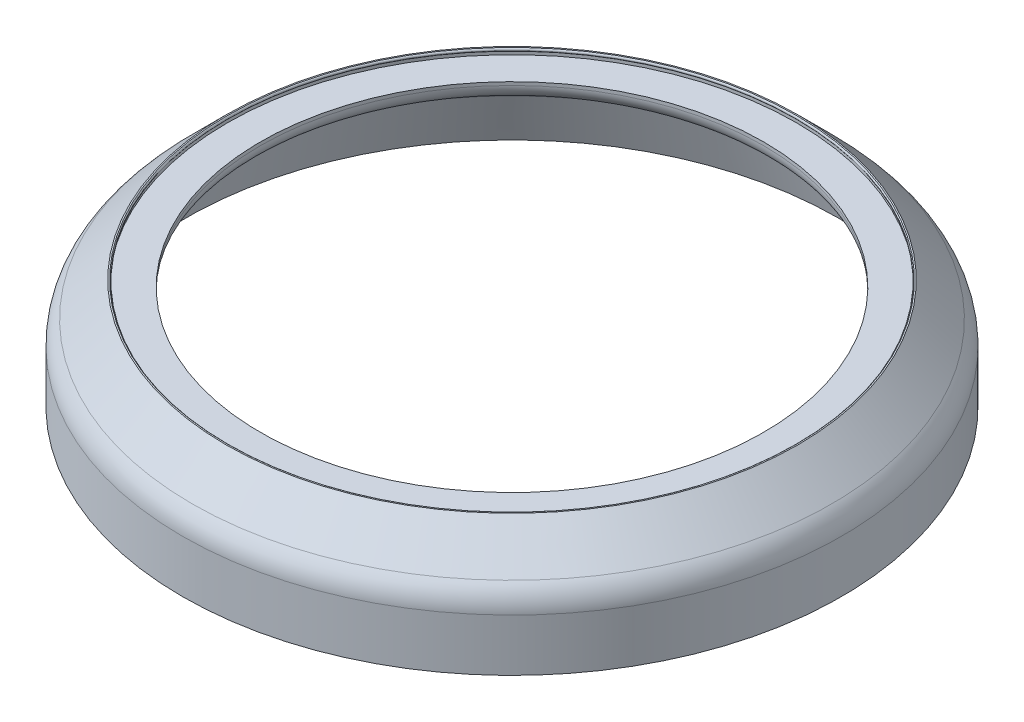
from build123d import *

# Parameters (mm, degrees)
FILLET1_R = 12.7
FILLET2_R = 6.35


with BuildPart() as part:
    # Sketch1 → Revolve1 (revolve)
    with BuildSketch(Plane.XY, mode=Mode.PRIVATE) as revolve1_sk:
        with BuildLine():
            Line((-127, -39.80755162), (-127, -14.40755162))
            Line((-127, -14.40755162), (-110.1725, 2.41994838))
            Line((-110.1725, 2.41994838), (-109.6645, 2.41994838))
            ThreePointArc((-109.6645, 2.41994838), (-109.284496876, 1.873528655), (-109.601, 1.288035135))
            ThreePointArc((-109.601, 1.288035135), (-109.647485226, 1.241549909), (-109.6645, 1.178049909))
            Line((-109.6645, 1.178049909), (-109.6645, 0))
            Line((-109.6645, 0), (-96.9645, 0))
            Line((-96.9645, 0), (-96.9645, -7.62))
            Line((-96.9645, -7.62), (-111.232192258, -7.62))
            Line((-111.232192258, -7.62), (-120.65, -17.037807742))
            Line((-120.65, -17.037807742), (-120.65, -20.848733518))
            Line((-120.65, -20.848733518), (-125.73, -39.80755162))
            Line((-125.73, -39.80755162), (-127, -39.80755162))
        make_face()
    revolve(revolve1_sk.sketch.rotate(Axis((0, 0, 0), (0, 1, 0)), 270), axis=Axis((0, 0, 0), (0, 1, 0)))

    # Fillet1
    fillet1_edges = [part.edges().sort_by_distance(p)[0] for p in [
        (0, -14.40755162, 127),
    ]]
    fillet(fillet1_edges, radius=FILLET1_R)

    # Fillet2
    fillet2_edges = [part.edges().sort_by_distance(p)[0] for p in [
        (0, -7.62, 96.9645),
        (0, -7.62, 111.232192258),
        (0, -17.037807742, 120.65),
        (0, -20.848733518, 120.65),
    ]]
    fillet(fillet2_edges, radius=FILLET2_R)


solid = part.part
